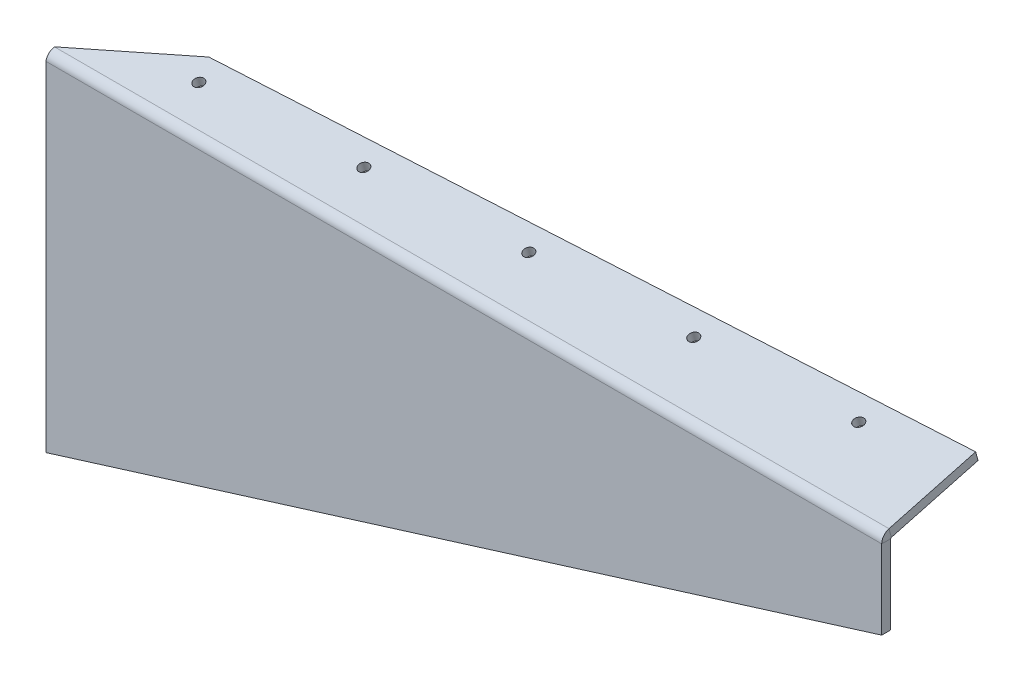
ISO-10303-21;
HEADER;
FILE_DESCRIPTION(('STEP AP214'),'2;1');
FILE_NAME('part.step','',(''),(''),'','','');
FILE_SCHEMA(('AUTOMOTIVE_DESIGN { 1 0 10303 214 1 1 1 1 }'));
ENDSEC;
DATA;
#1=APPLICATION_CONTEXT('core data for automotive mechanical design processes');
#2=APPLICATION_PROTOCOL_DEFINITION('international standard','automotive_design',2000,#1);
#3=PRODUCT_CONTEXT('',#1,'mechanical');
#4=PRODUCT('Part','Part','',(#3));
#5=PRODUCT_RELATED_PRODUCT_CATEGORY('part','',(#4));
#6=PRODUCT_DEFINITION_FORMATION('','',#4);
#7=PRODUCT_DEFINITION_CONTEXT('part definition',#1,'design');
#8=PRODUCT_DEFINITION('design','',#6,#7);
#9=PRODUCT_DEFINITION_SHAPE('','',#8);
#10=(LENGTH_UNIT() NAMED_UNIT(*) SI_UNIT(.MILLI.,.METRE.));
#11=(NAMED_UNIT(*) PLANE_ANGLE_UNIT() SI_UNIT($,.RADIAN.));
#12=(NAMED_UNIT(*) SI_UNIT($,.STERADIAN.) SOLID_ANGLE_UNIT());
#13=UNCERTAINTY_MEASURE_WITH_UNIT(LENGTH_MEASURE(1.E-05),#10,'distance_accuracy_value','');
#14=(GEOMETRIC_REPRESENTATION_CONTEXT(3) GLOBAL_UNCERTAINTY_ASSIGNED_CONTEXT((#13)) GLOBAL_UNIT_ASSIGNED_CONTEXT((#10,
#11,#12)) REPRESENTATION_CONTEXT('',''));
#15=CARTESIAN_POINT('',(0.,0.,0.));
#16=DIRECTION('',(0.,0.,1.));
#17=DIRECTION('',(1.,0.,0.));
#18=AXIS2_PLACEMENT_3D('',#15,#16,#17);
#19=CARTESIAN_POINT('',(0.,-300.,8.));
#20=DIRECTION('',(1.,0.,0.));
#21=DIRECTION('',(0.,0.,-1.));
#22=AXIS2_PLACEMENT_3D('',#19,#20,#21);
#23=PLANE('',#22);
#24=DIRECTION('',(0.,-1.,0.));
#25=VECTOR('',#24,1.);
#26=CARTESIAN_POINT('',(0.,-300.,0.));
#27=LINE('',#26,#25);
#28=CARTESIAN_POINT('',(0.,0.,0.));
#29=VERTEX_POINT('',#28);
#30=CARTESIAN_POINT('',(0.,-300.,0.));
#31=VERTEX_POINT('',#30);
#32=EDGE_CURVE('E175',#29,#31,#27,.T.);
#33=ORIENTED_EDGE('',*,*,#32,.T.);
#34=DIRECTION('',(0.,0.,-1.));
#35=VECTOR('',#34,1.);
#36=CARTESIAN_POINT('',(0.,-300.,8.));
#37=LINE('',#36,#35);
#38=CARTESIAN_POINT('',(0.,-300.,8.));
#39=VERTEX_POINT('',#38);
#40=EDGE_CURVE('E13',#39,#31,#37,.T.);
#41=ORIENTED_EDGE('',*,*,#40,.F.);
#42=DIRECTION('',(0.,-1.,0.));
#43=VECTOR('',#42,1.);
#44=CARTESIAN_POINT('',(0.,-300.,8.));
#45=LINE('',#44,#43);
#46=CARTESIAN_POINT('',(0.,0.,8.));
#47=VERTEX_POINT('',#46);
#48=EDGE_CURVE('E258',#47,#39,#45,.T.);
#49=ORIENTED_EDGE('',*,*,#48,.F.);
#50=DIRECTION('',(0.,0.,-1.));
#51=VECTOR('',#50,1.);
#52=CARTESIAN_POINT('',(0.,0.,8.));
#53=LINE('',#52,#51);
#54=EDGE_CURVE('E247',#47,#29,#53,.T.);
#55=ORIENTED_EDGE('',*,*,#54,.T.);
#56=EDGE_LOOP('',(#33,#41,#49,#55));
#57=FACE_BOUND('',#56,.T.);
#58=ADVANCED_FACE('F51',(#57),#23,.F.);
#59=CARTESIAN_POINT('',(740.,-70.,8.));
#60=DIRECTION('',(-0.296805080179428,0.95493808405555,0.));
#61=DIRECTION('',(-0.95493808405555,-0.296805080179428,0.));
#62=AXIS2_PLACEMENT_3D('',#59,#60,#61);
#63=PLANE('',#62);
#64=DIRECTION('',(0.954938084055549,0.296805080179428,0.));
#65=VECTOR('',#64,1.);
#66=CARTESIAN_POINT('',(740.,-70.,0.));
#67=LINE('',#66,#65);
#68=CARTESIAN_POINT('',(740.,-70.,0.));
#69=VERTEX_POINT('',#68);
#70=EDGE_CURVE('E250',#31,#69,#67,.T.);
#71=ORIENTED_EDGE('',*,*,#70,.T.);
#72=DIRECTION('',(0.,0.,-1.));
#73=VECTOR('',#72,1.);
#74=CARTESIAN_POINT('',(740.,-70.,8.));
#75=LINE('',#74,#73);
#76=CARTESIAN_POINT('',(740.,-70.,8.));
#77=VERTEX_POINT('',#76);
#78=EDGE_CURVE('E58',#77,#69,#75,.T.);
#79=ORIENTED_EDGE('',*,*,#78,.F.);
#80=DIRECTION('',(0.954938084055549,0.296805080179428,0.));
#81=VECTOR('',#80,1.);
#82=CARTESIAN_POINT('',(740.,-70.,8.));
#83=LINE('',#82,#81);
#84=EDGE_CURVE('E73',#39,#77,#83,.T.);
#85=ORIENTED_EDGE('',*,*,#84,.F.);
#86=ORIENTED_EDGE('',*,*,#40,.T.);
#87=EDGE_LOOP('',(#71,#79,#85,#86));
#88=FACE_BOUND('',#87,.T.);
#89=ADVANCED_FACE('F234',(#88),#63,.F.);
#90=CARTESIAN_POINT('',(740.,0.,8.));
#91=DIRECTION('',(-1.,0.,0.));
#92=DIRECTION('',(0.,0.,1.));
#93=AXIS2_PLACEMENT_3D('',#90,#91,#92);
#94=PLANE('',#93);
#95=DIRECTION('',(0.,1.,0.));
#96=VECTOR('',#95,1.);
#97=CARTESIAN_POINT('',(740.,0.,0.));
#98=LINE('',#97,#96);
#99=CARTESIAN_POINT('',(740.,0.,0.));
#100=VERTEX_POINT('',#99);
#101=EDGE_CURVE('E251',#69,#100,#98,.T.);
#102=ORIENTED_EDGE('',*,*,#101,.T.);
#103=DIRECTION('',(0.,0.,-1.));
#104=VECTOR('',#103,1.);
#105=CARTESIAN_POINT('',(740.,0.,8.));
#106=LINE('',#105,#104);
#107=CARTESIAN_POINT('',(740.,0.,8.00000000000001));
#108=VERTEX_POINT('',#107);
#109=EDGE_CURVE('E265',#108,#100,#106,.T.);
#110=ORIENTED_EDGE('',*,*,#109,.F.);
#111=DIRECTION('',(0.,1.,0.));
#112=VECTOR('',#111,1.);
#113=CARTESIAN_POINT('',(740.,0.,8.));
#114=LINE('',#113,#112);
#115=EDGE_CURVE('E261',#77,#108,#114,.T.);
#116=ORIENTED_EDGE('',*,*,#115,.F.);
#117=ORIENTED_EDGE('',*,*,#78,.T.);
#118=EDGE_LOOP('',(#102,#110,#116,#117));
#119=FACE_BOUND('',#118,.T.);
#120=ADVANCED_FACE('F240',(#119),#94,.F.);
#121=CARTESIAN_POINT('',(0.,0.,8.));
#122=DIRECTION('',(0.,0.,-1.));
#123=DIRECTION('',(-1.,0.,0.));
#124=AXIS2_PLACEMENT_3D('',#121,#122,#123);
#125=PLANE('',#124);
#126=ORIENTED_EDGE('',*,*,#48,.T.);
#127=ORIENTED_EDGE('',*,*,#84,.T.);
#128=ORIENTED_EDGE('',*,*,#115,.T.);
#129=DIRECTION('',(-1.,0.,0.));
#130=VECTOR('',#129,1.);
#131=CARTESIAN_POINT('',(0.,0.,8.));
#132=LINE('',#131,#130);
#133=EDGE_CURVE('E120',#108,#47,#132,.T.);
#134=ORIENTED_EDGE('',*,*,#133,.T.);
#135=EDGE_LOOP('',(#126,#127,#128,#134));
#136=FACE_BOUND('',#135,.T.);
#137=ADVANCED_FACE('F330',(#136),#125,.F.);
#138=CARTESIAN_POINT('',(0.,0.,0.));
#139=DIRECTION('',(0.,0.,-1.));
#140=DIRECTION('',(-1.,0.,0.));
#141=AXIS2_PLACEMENT_3D('',#138,#139,#140);
#142=PLANE('',#141);
#143=ORIENTED_EDGE('',*,*,#32,.F.);
#144=DIRECTION('',(-1.,0.,0.));
#145=VECTOR('',#144,1.);
#146=CARTESIAN_POINT('',(0.,0.,0.));
#147=LINE('',#146,#145);
#148=EDGE_CURVE('E256',#100,#29,#147,.T.);
#149=ORIENTED_EDGE('',*,*,#148,.F.);
#150=ORIENTED_EDGE('',*,*,#101,.F.);
#151=ORIENTED_EDGE('',*,*,#70,.F.);
#152=EDGE_LOOP('',(#143,#149,#150,#151));
#153=FACE_BOUND('',#152,.T.);
#154=ADVANCED_FACE('F271',(#153),#142,.T.);
#155=CARTESIAN_POINT('',(0.,0.,8.08000000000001));
#156=CARTESIAN_POINT('',(0.169795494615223,1.92609814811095,8.08000000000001));
#157=CARTESIAN_POINT('',(0.339127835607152,3.8412037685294,7.42902176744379));
#158=CARTESIAN_POINT('',(0.678255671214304,6.89320826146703,5.08713635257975));
#159=CARTESIAN_POINT('',(0.847588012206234,8.0176707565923,3.40577193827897));
#160=CARTESIAN_POINT('',(1.01738350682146,8.51618164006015,1.54530399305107));
#161=CARTESIAN_POINT('',(0.,0.,8.00000000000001));
#162=CARTESIAN_POINT('',(0.169794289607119,1.90862000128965,8.00000000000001));
#163=CARTESIAN_POINT('',(0.339127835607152,3.80634948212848,7.35492860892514));
#164=CARTESIAN_POINT('',(0.678255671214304,6.83066071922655,5.0342929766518));
#165=CARTESIAN_POINT('',(0.847589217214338,7.94492036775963,3.3681838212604));
#166=CARTESIAN_POINT('',(1.01738350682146,8.43890757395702,1.52459846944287));
#167=CARTESIAN_POINT('',(0.,0.,0.));
#168=CARTESIAN_POINT('',(0.169673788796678,0.160805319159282,0.));
#169=CARTESIAN_POINT('',(0.339127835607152,0.320920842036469,-0.05438724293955));
#170=CARTESIAN_POINT('',(0.678255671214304,0.57590649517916,-0.250044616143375));
#171=CARTESIAN_POINT('',(0.847709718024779,0.669881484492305,-0.390627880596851));
#172=CARTESIAN_POINT('',(1.01738350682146,0.711500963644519,-0.545953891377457));
#173=CARTESIAN_POINT('',(0.,0.,-0.0807999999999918));
#174=CARTESIAN_POINT('',(0.169672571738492,0.143152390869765,-0.0807999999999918));
#175=CARTESIAN_POINT('',(0.339127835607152,0.28571801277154,-0.129221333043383));
#176=CARTESIAN_POINT('',(0.678255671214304,0.512733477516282,-0.303416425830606));
#177=CARTESIAN_POINT('',(0.847710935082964,0.596403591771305,-0.42859187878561));
#178=CARTESIAN_POINT('',(1.01738350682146,0.633454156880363,-0.566866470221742));
#179=B_SPLINE_SURFACE_WITH_KNOTS('',1,3,((#155,#156,#157,#158,#159,#160),(#161,#162,#163,#164,
#165,#166),(#167,#168,#169,#170,#171,#172),(#173,#174,#175,#176,#177,#178)),.UNSPECIFIED.,.F.,
.F.,.F.,(2,1,1,2),(4,2,4),(-0.01,0.,1.,1.0101),(0.,0.5,1.),.UNSPECIFIED.);
#180=DIRECTION('',(0.,0.965925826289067,0.258819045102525));
#181=VECTOR('',#180,1.);
#182=CARTESIAN_POINT('',(1.01738350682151,8.43890757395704,1.52459846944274));
#183=LINE('',#182,#181);
#184=CARTESIAN_POINT('',(1.01738350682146,0.711500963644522,-0.545953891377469));
#185=VERTEX_POINT('',#184);
#186=CARTESIAN_POINT('',(1.01738350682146,8.43890757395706,1.52459846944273));
#187=VERTEX_POINT('',#186);
#188=EDGE_CURVE('E164',#185,#187,#183,.T.);
#189=CARTESIAN_POINT('',(0.,0.,0.));
#190=CARTESIAN_POINT('',(0.0318540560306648,0.0301819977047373,8.96684749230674E-06));
#191=CARTESIAN_POINT('',(0.0637073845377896,0.0603611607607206,-0.00185486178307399));
#192=CARTESIAN_POINT('',(0.127407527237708,0.1202660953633,-0.00926031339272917));
#193=CARTESIAN_POINT('',(0.159254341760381,0.149991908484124,-0.0148015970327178));
#194=CARTESIAN_POINT('',(0.22288347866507,0.208494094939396,-0.0294806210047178));
#195=CARTESIAN_POINT('',(0.254665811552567,0.237272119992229,-0.0386117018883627));
#196=CARTESIAN_POINT('',(0.318225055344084,0.293483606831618,-0.0603188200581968));
#197=CARTESIAN_POINT('',(0.350001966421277,0.320917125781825,-0.0728947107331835));
#198=CARTESIAN_POINT('',(0.445543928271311,0.40075004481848,-0.11561791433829));
#199=CARTESIAN_POINT('',(0.509365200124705,0.450535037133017,-0.150723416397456));
#200=CARTESIAN_POINT('',(0.636915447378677,0.53999714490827,-0.231988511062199));
#201=CARTESIAN_POINT('',(0.70064445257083,0.579683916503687,-0.278137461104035));
#202=CARTESIAN_POINT('',(0.806514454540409,0.635303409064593,-0.361673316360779));
#203=CARTESIAN_POINT('',(0.84867723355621,0.654731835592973,-0.39675549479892));
#204=CARTESIAN_POINT('',(0.9330127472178,0.687670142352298,-0.469587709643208));
#205=CARTESIAN_POINT('',(0.975185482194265,0.701179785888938,-0.507337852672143));
#206=CARTESIAN_POINT('',(1.01738350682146,0.711500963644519,-0.545953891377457));
#207=B_SPLINE_CURVE_WITH_KNOTS('',3,(#189,#190,#191,#192,#193,#194,#195,#196,#197,#198,#199,
#200,#201,#202,#203,#204,#205,#206),.UNSPECIFIED.,.F.,.F.,(4,2,2,2,2,2,2,2,4),(0.,
0.131602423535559,0.263192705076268,0.394540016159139,0.525881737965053,0.789206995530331,
1.05227950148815,1.22650322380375,1.40073391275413),.UNSPECIFIED.);
#208=EDGE_CURVE('E122',#29,#185,#207,.T.);
#209=CARTESIAN_POINT('',(0.,0.,8.00000000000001));
#210=CARTESIAN_POINT('',(0.0219467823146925,0.246676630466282,8.0000267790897));
#211=CARTESIAN_POINT('',(0.043897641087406,0.493349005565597,7.9895538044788));
#212=CARTESIAN_POINT('',(0.0877981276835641,0.984915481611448,7.94780196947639));
#213=CARTESIAN_POINT('',(0.109747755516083,1.22980966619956,7.9165240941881));
#214=CARTESIAN_POINT('',(0.15362768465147,1.71595413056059,7.83337649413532));
#215=CARTESIAN_POINT('',(0.175557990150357,1.95720614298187,7.78151690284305));
#216=CARTESIAN_POINT('',(0.219412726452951,2.43445876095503,7.6575862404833));
#217=CARTESIAN_POINT('',(0.241337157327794,2.67045943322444,7.58551542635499));
#218=CARTESIAN_POINT('',(0.285195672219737,3.13561806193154,7.42164204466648));
#219=CARTESIAN_POINT('',(0.307129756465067,3.36477313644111,7.32983129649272));
#220=CARTESIAN_POINT('',(0.351004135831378,3.81449832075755,7.12715324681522));
#221=CARTESIAN_POINT('',(0.372944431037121,4.03506830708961,7.01628567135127));
#222=CARTESIAN_POINT('',(0.416826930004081,4.4659713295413,6.77632722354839));
#223=CARTESIAN_POINT('',(0.438769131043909,4.6763075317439,6.64724203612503));
#224=CARTESIAN_POINT('',(0.482647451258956,5.0853084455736,6.3717479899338));
#225=CARTESIAN_POINT('',(0.504583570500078,5.2839732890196,6.22533932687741));
#226=CARTESIAN_POINT('',(0.548457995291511,5.6681801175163,5.91627077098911));
#227=CARTESIAN_POINT('',(0.570396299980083,5.85372412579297,5.75361339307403));
#228=CARTESIAN_POINT('',(0.614278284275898,6.21047423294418,5.41311683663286));
#229=CARTESIAN_POINT('',(0.636221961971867,6.38167395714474,5.23527097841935));
#230=CARTESIAN_POINT('',(0.680104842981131,6.70844150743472,4.86570697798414));
#231=CARTESIAN_POINT('',(0.70204404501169,6.86400682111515,4.67398661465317));
#232=CARTESIAN_POINT('',(0.745908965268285,7.15829065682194,4.27816190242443));
#233=CARTESIAN_POINT('',(0.767834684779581,7.29701750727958,4.07406375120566));
#234=CARTESIAN_POINT('',(0.808729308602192,7.53919006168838,3.68316230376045));
#235=CARTESIAN_POINT('',(0.827698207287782,7.64487072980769,3.49773852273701));
#236=CARTESIAN_POINT('',(0.865640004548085,7.84237504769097,3.11966939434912));
#237=CARTESIAN_POINT('',(0.884612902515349,7.9342001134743,2.92702478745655));
#238=CARTESIAN_POINT('',(0.922551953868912,8.10344962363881,2.53566082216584));
#239=CARTESIAN_POINT('',(0.941518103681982,8.18088334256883,2.33694547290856));
#240=CARTESIAN_POINT('',(0.979451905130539,8.32103589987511,1.93436317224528));
#241=CARTESIAN_POINT('',(0.998419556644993,8.38375284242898,1.73049556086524));
#242=CARTESIAN_POINT('',(1.01738350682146,8.43890757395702,1.52459846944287));
#243=B_SPLINE_CURVE_WITH_KNOTS('',3,(#209,#210,#211,#212,#213,#214,#215,#216,#217,#218,#219,
#220,#221,#222,#223,#224,#225,#226,#227,#228,#229,#230,#231,#232,#233,#234,#235,#236,#237,#238,
#239,#240,#241,#242),.UNSPECIFIED.,.F.,.F.,(4,2,2,2,2,2,2,2,2,2,2,2,2,2,2,2,4),(0.,
0.74272618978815,1.48541721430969,2.22774302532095,2.97005939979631,3.71268399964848,
4.4553192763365,5.19772331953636,5.94011897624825,6.68239990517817,7.42500897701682,
8.16773719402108,8.91009654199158,9.55234285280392,10.194523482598,10.8362888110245,
11.4781367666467),.UNSPECIFIED.);
#244=EDGE_CURVE('E65',#47,#187,#243,.T.);
#245=ORIENTED_EDGE('',*,*,#188,.F.);
#246=ORIENTED_EDGE('',*,*,#208,.F.);
#247=ORIENTED_EDGE('',*,*,#54,.F.);
#248=ORIENTED_EDGE('',*,*,#244,.T.);
#249=EDGE_LOOP('',(#245,#246,#247,#248));
#250=FACE_BOUND('',#249,.T.);
#251=ADVANCED_FACE('F181',(#250),#179,.F.);
#252=CARTESIAN_POINT('',(740.,0.,-0.736599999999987));
#253=DIRECTION('',(-1.,0.,0.));
#254=DIRECTION('',(0.,0.,1.));
#255=AXIS2_PLACEMENT_3D('',#252,#253,#254);
#256=PLANE('',#255);
#257=CARTESIAN_POINT('',(740.,0.,-0.736599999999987));
#258=DIRECTION('',(1.,0.,0.));
#259=DIRECTION('',(0.,0.,-1.));
#260=AXIS2_PLACEMENT_3D('',#257,#258,#259);
#261=CIRCLE('',#260,0.736599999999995);
#262=CARTESIAN_POINT('',(740.,0.711500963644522,-0.545953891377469));
#263=VERTEX_POINT('',#262);
#264=EDGE_CURVE('E129',#263,#100,#261,.T.);
#265=ORIENTED_EDGE('',*,*,#264,.F.);
#266=DIRECTION('',(0.,0.965925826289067,0.258819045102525));
#267=VECTOR('',#266,1.);
#268=CARTESIAN_POINT('',(740.,0.711500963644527,-0.54595389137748));
#269=LINE('',#268,#267);
#270=CARTESIAN_POINT('',(740.,8.43890757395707,1.52459846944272));
#271=VERTEX_POINT('',#270);
#272=EDGE_CURVE('E126',#263,#271,#269,.T.);
#273=ORIENTED_EDGE('',*,*,#272,.T.);
#274=CARTESIAN_POINT('',(740.,0.,-0.736599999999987));
#275=DIRECTION('',(1.,0.,0.));
#276=DIRECTION('',(0.,0.,-1.));
#277=AXIS2_PLACEMENT_3D('',#274,#275,#276);
#278=CIRCLE('',#277,8.7366);
#279=EDGE_CURVE('E114',#271,#108,#278,.T.);
#280=ORIENTED_EDGE('',*,*,#279,.T.);
#281=ORIENTED_EDGE('',*,*,#109,.T.);
#282=EDGE_LOOP('',(#265,#273,#280,#281));
#283=FACE_BOUND('',#282,.T.);
#284=ADVANCED_FACE('F127',(#283),#256,.F.);
#285=CARTESIAN_POINT('',(740.,0.,-0.736599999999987));
#286=DIRECTION('',(1.,0.,0.));
#287=DIRECTION('',(0.,0.965925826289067,0.258819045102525));
#288=AXIS2_PLACEMENT_3D('',#285,#286,#287);
#289=CYLINDRICAL_SURFACE('',#288,8.7366);
#290=ORIENTED_EDGE('',*,*,#133,.F.);
#291=ORIENTED_EDGE('',*,*,#279,.F.);
#292=DIRECTION('',(1.,0.,0.));
#293=VECTOR('',#292,1.);
#294=CARTESIAN_POINT('',(740.,8.43890757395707,1.52459846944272));
#295=LINE('',#294,#293);
#296=EDGE_CURVE('E118',#187,#271,#295,.T.);
#297=ORIENTED_EDGE('',*,*,#296,.F.);
#298=ORIENTED_EDGE('',*,*,#244,.F.);
#299=EDGE_LOOP('',(#290,#291,#297,#298));
#300=FACE_BOUND('',#299,.T.);
#301=ADVANCED_FACE('F116',(#300),#289,.T.);
#302=CARTESIAN_POINT('',(740.,0.,-0.736599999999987));
#303=DIRECTION('',(1.,0.,0.));
#304=DIRECTION('',(0.,0.965925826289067,0.258819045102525));
#305=AXIS2_PLACEMENT_3D('',#302,#303,#304);
#306=CYLINDRICAL_SURFACE('',#305,0.736599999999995);
#307=ORIENTED_EDGE('',*,*,#148,.T.);
#308=ORIENTED_EDGE('',*,*,#208,.T.);
#309=DIRECTION('',(-1.,0.,0.));
#310=VECTOR('',#309,1.);
#311=CARTESIAN_POINT('',(1.01738350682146,0.71150096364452,-0.545953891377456));
#312=LINE('',#311,#310);
#313=EDGE_CURVE('E134',#185,#263,#312,.F.);
#314=ORIENTED_EDGE('',*,*,#313,.T.);
#315=ORIENTED_EDGE('',*,*,#264,.T.);
#316=EDGE_LOOP('',(#307,#308,#314,#315));
#317=FACE_BOUND('',#316,.T.);
#318=ADVANCED_FACE('F188',(#317),#306,.F.);
#319=CARTESIAN_POINT('',(740.,8.29261966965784,2.0705523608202));
#320=DIRECTION('',(1.,0.,0.));
#321=DIRECTION('',(0.,0.,-1.));
#322=AXIS2_PLACEMENT_3D('',#319,#320,#321);
#323=PLANE('',#322);
#324=DIRECTION('',(0.,-0.258819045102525,0.965925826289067));
#325=VECTOR('',#324,1.);
#326=CARTESIAN_POINT('',(740.,8.29261966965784,2.0705523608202));
#327=LINE('',#326,#325);
#328=CARTESIAN_POINT('',(740.,28.9981432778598,-75.2035137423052));
#329=VERTEX_POINT('',#328);
#330=EDGE_CURVE('E141',#329,#271,#327,.T.);
#331=ORIENTED_EDGE('',*,*,#330,.T.);
#332=ORIENTED_EDGE('',*,*,#272,.F.);
#333=DIRECTION('',(0.,0.258819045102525,-0.965925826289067));
#334=VECTOR('',#333,1.);
#335=CARTESIAN_POINT('',(740.,0.5652130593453,0.));
#336=LINE('',#335,#334);
#337=CARTESIAN_POINT('',(740.,21.2707366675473,-77.2740661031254));
#338=VERTEX_POINT('',#337);
#339=EDGE_CURVE('E157',#338,#263,#336,.F.);
#340=ORIENTED_EDGE('',*,*,#339,.F.);
#341=DIRECTION('',(0.,-0.965925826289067,-0.258819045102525));
#342=VECTOR('',#341,1.);
#343=CARTESIAN_POINT('',(740.,28.9981432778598,-75.2035137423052));
#344=LINE('',#343,#342);
#345=EDGE_CURVE('E146',#329,#338,#344,.T.);
#346=ORIENTED_EDGE('',*,*,#345,.F.);
#347=EDGE_LOOP('',(#331,#332,#340,#346));
#348=FACE_BOUND('',#347,.T.);
#349=ADVANCED_FACE('F145',(#348),#323,.T.);
#350=CARTESIAN_POINT('',(90.,21.2335719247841,-46.2257389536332));
#351=DIRECTION('',(-0.485642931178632,0.2262485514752,-0.844371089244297));
#352=DIRECTION('',(-0.866848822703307,0.,0.498571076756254));
#353=AXIS2_PLACEMENT_3D('',#350,#351,#352);
#354=PLANE('',#353);
#355=DIRECTION('',(-0.874157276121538,-0.125693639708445,0.469095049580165));
#356=VECTOR('',#355,1.);
#357=CARTESIAN_POINT('',(565.471698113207,81.8734602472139,-303.44650957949));
#358=LINE('',#357,#356);
#359=CARTESIAN_POINT('',(89.9999999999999,13.5061653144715,-48.2962913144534));
#360=VERTEX_POINT('',#359);
#361=EDGE_CURVE('E143',#185,#360,#358,.F.);
#362=ORIENTED_EDGE('',*,*,#361,.F.);
#363=ORIENTED_EDGE('',*,*,#188,.T.);
#364=DIRECTION('',(0.874157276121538,0.125693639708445,-0.469095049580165));
#365=VECTOR('',#364,1.);
#366=CARTESIAN_POINT('',(90.,21.2335719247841,-46.2257389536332));
#367=LINE('',#366,#365);
#368=CARTESIAN_POINT('',(89.9999999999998,21.2335719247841,-46.2257389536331));
#369=VERTEX_POINT('',#368);
#370=EDGE_CURVE('E142',#187,#369,#367,.T.);
#371=ORIENTED_EDGE('',*,*,#370,.T.);
#372=DIRECTION('',(0.,-0.965925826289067,-0.258819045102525));
#373=VECTOR('',#372,1.);
#374=CARTESIAN_POINT('',(90.,21.2335719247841,-46.2257389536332));
#375=LINE('',#374,#373);
#376=EDGE_CURVE('E148',#369,#360,#375,.T.);
#377=ORIENTED_EDGE('',*,*,#376,.T.);
#378=EDGE_LOOP('',(#362,#363,#371,#377));
#379=FACE_BOUND('',#378,.T.);
#380=ADVANCED_FACE('F193',(#379),#354,.T.);
#381=CARTESIAN_POINT('',(740.,8.29261966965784,2.0705523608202));
#382=DIRECTION('',(0.,0.965925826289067,0.258819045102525));
#383=DIRECTION('',(0.,-0.258819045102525,0.965925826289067));
#384=AXIS2_PLACEMENT_3D('',#381,#382,#383);
#385=PLANE('',#384);
#386=CARTESIAN_POINT('',(659.404501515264,22.8534989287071,-52.2713888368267));
#387=DIRECTION('',(0.,0.965925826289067,0.258819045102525));
#388=DIRECTION('',(0.,-0.258819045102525,0.965925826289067));
#389=AXIS2_PLACEMENT_3D('',#386,#387,#388);
#390=CIRCLE('',#389,4.49999999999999);
#391=CARTESIAN_POINT('',(659.404501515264,21.6888132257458,-47.9247226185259));
#392=VERTEX_POINT('',#391);
#393=EDGE_CURVE('E304',#392,#392,#390,.T.);
#394=ORIENTED_EDGE('',*,*,#393,.F.);
#395=EDGE_LOOP('',(#394));
#396=FACE_BOUND('',#395,.T.);
#397=CARTESIAN_POINT('',(519.553376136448,21.1829080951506,-46.0366589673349));
#398=DIRECTION('',(0.,0.965925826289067,0.258819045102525));
#399=DIRECTION('',(0.,-0.258819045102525,0.965925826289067));
#400=AXIS2_PLACEMENT_3D('',#397,#398,#399);
#401=CIRCLE('',#400,4.49999999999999);
#402=CARTESIAN_POINT('',(519.553376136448,20.0182223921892,-41.6899927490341));
#403=VERTEX_POINT('',#402);
#404=EDGE_CURVE('E298',#403,#403,#401,.T.);
#405=ORIENTED_EDGE('',*,*,#404,.F.);
#406=EDGE_LOOP('',(#405));
#407=FACE_BOUND('',#406,.T.);
#408=CARTESIAN_POINT('',(379.702250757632,19.512317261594,-39.8019290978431));
#409=DIRECTION('',(0.,0.965925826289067,0.258819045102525));
#410=DIRECTION('',(0.,-0.258819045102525,0.965925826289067));
#411=AXIS2_PLACEMENT_3D('',#408,#409,#410);
#412=CIRCLE('',#411,4.49999999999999);
#413=CARTESIAN_POINT('',(379.702250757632,18.3476315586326,-35.4552628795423));
#414=VERTEX_POINT('',#413);
#415=EDGE_CURVE('E292',#414,#414,#412,.T.);
#416=ORIENTED_EDGE('',*,*,#415,.F.);
#417=EDGE_LOOP('',(#416));
#418=FACE_BOUND('',#417,.T.);
#419=CARTESIAN_POINT('',(239.851125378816,17.8417264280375,-33.5671992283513));
#420=DIRECTION('',(0.,0.965925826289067,0.258819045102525));
#421=DIRECTION('',(0.,-0.258819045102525,0.965925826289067));
#422=AXIS2_PLACEMENT_3D('',#419,#420,#421);
#423=CIRCLE('',#422,4.49999999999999);
#424=CARTESIAN_POINT('',(239.851125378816,16.6770407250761,-29.2205330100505));
#425=VERTEX_POINT('',#424);
#426=EDGE_CURVE('E286',#425,#425,#423,.T.);
#427=ORIENTED_EDGE('',*,*,#426,.F.);
#428=EDGE_LOOP('',(#427));
#429=FACE_BOUND('',#428,.T.);
#430=CARTESIAN_POINT('',(100.,16.1711355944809,-27.3324693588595));
#431=DIRECTION('',(0.,0.965925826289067,0.258819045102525));
#432=DIRECTION('',(0.,-0.258819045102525,0.965925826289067));
#433=AXIS2_PLACEMENT_3D('',#430,#431,#432);
#434=CIRCLE('',#433,4.49999999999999);
#435=CARTESIAN_POINT('',(100.,15.0064498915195,-22.9858031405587));
#436=VERTEX_POINT('',#435);
#437=EDGE_CURVE('E167',#436,#436,#434,.T.);
#438=ORIENTED_EDGE('',*,*,#437,.F.);
#439=EDGE_LOOP('',(#438));
#440=FACE_BOUND('',#439,.T.);
#441=ORIENTED_EDGE('',*,*,#370,.F.);
#442=ORIENTED_EDGE('',*,*,#296,.T.);
#443=ORIENTED_EDGE('',*,*,#330,.F.);
#444=DIRECTION('',(0.998936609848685,0.0119327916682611,-0.0445337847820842));
#445=VECTOR('',#444,1.);
#446=CARTESIAN_POINT('',(740.,28.9981432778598,-75.2035137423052));
#447=LINE('',#446,#445);
#448=EDGE_CURVE('E149',#369,#329,#447,.T.);
#449=ORIENTED_EDGE('',*,*,#448,.F.);
#450=EDGE_LOOP('',(#441,#442,#443,#449));
#451=FACE_BOUND('',#450,.T.);
#452=ADVANCED_FACE('F139',(#396,#407,#418,#429,#440,#451),#385,.T.);
#453=CARTESIAN_POINT('',(740.,0.5652130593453,0.));
#454=DIRECTION('',(0.,0.965925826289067,0.258819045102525));
#455=DIRECTION('',(0.,-0.258819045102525,0.965925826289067));
#456=AXIS2_PLACEMENT_3D('',#453,#454,#455);
#457=PLANE('',#456);
#458=CARTESIAN_POINT('',(659.404501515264,15.1260923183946,-54.3419411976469));
#459=DIRECTION('',(0.,-0.965925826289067,-0.258819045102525));
#460=DIRECTION('',(0.,0.258819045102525,-0.965925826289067));
#461=AXIS2_PLACEMENT_3D('',#458,#459,#460);
#462=CIRCLE('',#461,4.49999999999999);
#463=CARTESIAN_POINT('',(659.404501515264,16.2907780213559,-58.6886074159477));
#464=VERTEX_POINT('',#463);
#465=EDGE_CURVE('E306',#464,#464,#462,.T.);
#466=ORIENTED_EDGE('',*,*,#465,.F.);
#467=EDGE_LOOP('',(#466));
#468=FACE_BOUND('',#467,.T.);
#469=CARTESIAN_POINT('',(519.553376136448,13.455501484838,-48.1072113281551));
#470=DIRECTION('',(0.,-0.965925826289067,-0.258819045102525));
#471=DIRECTION('',(0.,0.258819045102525,-0.965925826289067));
#472=AXIS2_PLACEMENT_3D('',#469,#470,#471);
#473=CIRCLE('',#472,4.49999999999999);
#474=CARTESIAN_POINT('',(519.553376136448,14.6201871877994,-52.4538775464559));
#475=VERTEX_POINT('',#474);
#476=EDGE_CURVE('E301',#475,#475,#473,.T.);
#477=ORIENTED_EDGE('',*,*,#476,.F.);
#478=EDGE_LOOP('',(#477));
#479=FACE_BOUND('',#478,.T.);
#480=CARTESIAN_POINT('',(379.702250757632,11.7849106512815,-41.8724814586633));
#481=DIRECTION('',(0.,-0.965925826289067,-0.258819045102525));
#482=DIRECTION('',(0.,0.258819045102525,-0.965925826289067));
#483=AXIS2_PLACEMENT_3D('',#480,#481,#482);
#484=CIRCLE('',#483,4.49999999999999);
#485=CARTESIAN_POINT('',(379.702250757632,12.9495963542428,-46.2191476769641));
#486=VERTEX_POINT('',#485);
#487=EDGE_CURVE('E295',#486,#486,#484,.T.);
#488=ORIENTED_EDGE('',*,*,#487,.F.);
#489=EDGE_LOOP('',(#488));
#490=FACE_BOUND('',#489,.T.);
#491=CARTESIAN_POINT('',(239.851125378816,10.1143198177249,-35.6377515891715));
#492=DIRECTION('',(0.,-0.965925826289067,-0.258819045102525));
#493=DIRECTION('',(0.,0.258819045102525,-0.965925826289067));
#494=AXIS2_PLACEMENT_3D('',#491,#492,#493);
#495=CIRCLE('',#494,4.49999999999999);
#496=CARTESIAN_POINT('',(239.851125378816,11.2790055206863,-39.9844178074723));
#497=VERTEX_POINT('',#496);
#498=EDGE_CURVE('E289',#497,#497,#495,.T.);
#499=ORIENTED_EDGE('',*,*,#498,.F.);
#500=EDGE_LOOP('',(#499));
#501=FACE_BOUND('',#500,.T.);
#502=CARTESIAN_POINT('',(100.,8.44372898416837,-29.4030217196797));
#503=DIRECTION('',(0.,-0.965925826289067,-0.258819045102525));
#504=DIRECTION('',(0.,0.258819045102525,-0.965925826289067));
#505=AXIS2_PLACEMENT_3D('',#502,#503,#504);
#506=CIRCLE('',#505,4.49999999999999);
#507=CARTESIAN_POINT('',(100.,9.60841468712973,-33.7496879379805));
#508=VERTEX_POINT('',#507);
#509=EDGE_CURVE('E283',#508,#508,#506,.T.);
#510=ORIENTED_EDGE('',*,*,#509,.F.);
#511=EDGE_LOOP('',(#510));
#512=FACE_BOUND('',#511,.T.);
#513=ORIENTED_EDGE('',*,*,#313,.F.);
#514=ORIENTED_EDGE('',*,*,#361,.T.);
#515=DIRECTION('',(-0.998936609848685,-0.0119327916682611,0.0445337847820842));
#516=VECTOR('',#515,1.);
#517=CARTESIAN_POINT('',(736.315540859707,21.2267239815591,-77.10980852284));
#518=LINE('',#517,#516);
#519=EDGE_CURVE('E159',#360,#338,#518,.F.);
#520=ORIENTED_EDGE('',*,*,#519,.T.);
#521=ORIENTED_EDGE('',*,*,#339,.T.);
#522=EDGE_LOOP('',(#513,#514,#520,#521));
#523=FACE_BOUND('',#522,.T.);
#524=ADVANCED_FACE('F201',(#468,#479,#490,#501,#512,#523),#457,.F.);
#525=CARTESIAN_POINT('',(740.,28.9981432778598,-75.2035137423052));
#526=DIRECTION('',(-0.0461047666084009,0.25854381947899,-0.964898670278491));
#527=DIRECTION('',(0.,0.965925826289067,0.258819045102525));
#528=AXIS2_PLACEMENT_3D('',#525,#526,#527);
#529=PLANE('',#528);
#530=ORIENTED_EDGE('',*,*,#519,.F.);
#531=ORIENTED_EDGE('',*,*,#376,.F.);
#532=ORIENTED_EDGE('',*,*,#448,.T.);
#533=ORIENTED_EDGE('',*,*,#345,.T.);
#534=EDGE_LOOP('',(#530,#531,#532,#533));
#535=FACE_BOUND('',#534,.T.);
#536=ADVANCED_FACE('F197',(#535),#529,.T.);
#537=CARTESIAN_POINT('',(100.,18.102987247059,-26.8148312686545));
#538=DIRECTION('',(0.,-0.965925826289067,-0.258819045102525));
#539=DIRECTION('',(0.,0.258819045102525,-0.965925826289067));
#540=AXIS2_PLACEMENT_3D('',#537,#538,#539);
#541=CYLINDRICAL_SURFACE('',#540,4.49999999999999);
#542=ORIENTED_EDGE('',*,*,#437,.T.);
#543=EDGE_LOOP('',(#542));
#544=FACE_BOUND('',#543,.T.);
#545=ORIENTED_EDGE('',*,*,#509,.T.);
#546=EDGE_LOOP('',(#545));
#547=FACE_BOUND('',#546,.T.);
#548=ADVANCED_FACE('F200',(#544,#547),#541,.F.);
#549=CARTESIAN_POINT('',(239.851125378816,19.7735780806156,-33.0495611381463));
#550=DIRECTION('',(0.,-0.965925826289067,-0.258819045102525));
#551=DIRECTION('',(0.,0.258819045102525,-0.965925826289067));
#552=AXIS2_PLACEMENT_3D('',#549,#550,#551);
#553=CYLINDRICAL_SURFACE('',#552,4.49999999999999);
#554=ORIENTED_EDGE('',*,*,#426,.T.);
#555=EDGE_LOOP('',(#554));
#556=FACE_BOUND('',#555,.T.);
#557=ORIENTED_EDGE('',*,*,#498,.T.);
#558=EDGE_LOOP('',(#557));
#559=FACE_BOUND('',#558,.T.);
#560=ADVANCED_FACE('F213',(#556,#559),#553,.F.);
#561=CARTESIAN_POINT('',(379.702250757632,21.4441689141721,-39.284291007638));
#562=DIRECTION('',(0.,-0.965925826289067,-0.258819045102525));
#563=DIRECTION('',(0.,0.258819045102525,-0.965925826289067));
#564=AXIS2_PLACEMENT_3D('',#561,#562,#563);
#565=CYLINDRICAL_SURFACE('',#564,4.49999999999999);
#566=ORIENTED_EDGE('',*,*,#415,.T.);
#567=EDGE_LOOP('',(#566));
#568=FACE_BOUND('',#567,.T.);
#569=ORIENTED_EDGE('',*,*,#487,.T.);
#570=EDGE_LOOP('',(#569));
#571=FACE_BOUND('',#570,.T.);
#572=ADVANCED_FACE('F217',(#568,#571),#565,.F.);
#573=CARTESIAN_POINT('',(519.553376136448,23.1147597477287,-45.5190208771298));
#574=DIRECTION('',(0.,-0.965925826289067,-0.258819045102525));
#575=DIRECTION('',(0.,0.258819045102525,-0.965925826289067));
#576=AXIS2_PLACEMENT_3D('',#573,#574,#575);
#577=CYLINDRICAL_SURFACE('',#576,4.49999999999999);
#578=ORIENTED_EDGE('',*,*,#404,.T.);
#579=EDGE_LOOP('',(#578));
#580=FACE_BOUND('',#579,.T.);
#581=ORIENTED_EDGE('',*,*,#476,.T.);
#582=EDGE_LOOP('',(#581));
#583=FACE_BOUND('',#582,.T.);
#584=ADVANCED_FACE('F221',(#580,#583),#577,.F.);
#585=CARTESIAN_POINT('',(659.404501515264,24.7853505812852,-51.7537507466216));
#586=DIRECTION('',(0.,-0.965925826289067,-0.258819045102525));
#587=DIRECTION('',(0.,0.258819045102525,-0.965925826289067));
#588=AXIS2_PLACEMENT_3D('',#585,#586,#587);
#589=CYLINDRICAL_SURFACE('',#588,4.49999999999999);
#590=ORIENTED_EDGE('',*,*,#393,.T.);
#591=EDGE_LOOP('',(#590));
#592=FACE_BOUND('',#591,.T.);
#593=ORIENTED_EDGE('',*,*,#465,.T.);
#594=EDGE_LOOP('',(#593));
#595=FACE_BOUND('',#594,.T.);
#596=ADVANCED_FACE('F225',(#592,#595),#589,.F.);
#597=CLOSED_SHELL('',(#58,#89,#120,#137,#154,#251,#284,#301,#318,#349,#380,#452,#524,#536,#548,
#560,#572,#584,#596));
#598=MANIFOLD_SOLID_BREP('B2',#597);
#599=ADVANCED_BREP_SHAPE_REPRESENTATION('',(#18,#598),#14);
#600=SHAPE_DEFINITION_REPRESENTATION(#9,#599);
ENDSEC;
END-ISO-10303-21;
